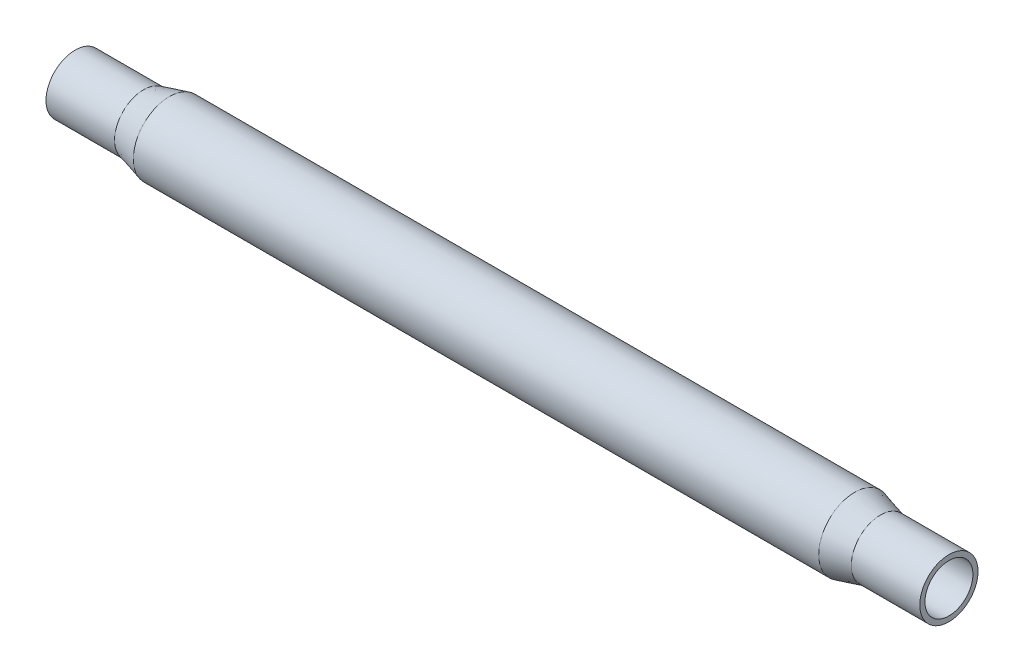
ISO-10303-21;
HEADER;
FILE_DESCRIPTION(('STEP AP214'),'2;1');
FILE_NAME('part.step','',(''),(''),'','','');
FILE_SCHEMA(('AUTOMOTIVE_DESIGN { 1 0 10303 214 1 1 1 1 }'));
ENDSEC;
DATA;
#1=APPLICATION_CONTEXT('core data for automotive mechanical design processes');
#2=APPLICATION_PROTOCOL_DEFINITION('international standard','automotive_design',2000,#1);
#3=PRODUCT_CONTEXT('',#1,'mechanical');
#4=PRODUCT('Part','Part','',(#3));
#5=PRODUCT_RELATED_PRODUCT_CATEGORY('part','',(#4));
#6=PRODUCT_DEFINITION_FORMATION('','',#4);
#7=PRODUCT_DEFINITION_CONTEXT('part definition',#1,'design');
#8=PRODUCT_DEFINITION('design','',#6,#7);
#9=PRODUCT_DEFINITION_SHAPE('','',#8);
#10=(LENGTH_UNIT() NAMED_UNIT(*) SI_UNIT(.MILLI.,.METRE.));
#11=(NAMED_UNIT(*) PLANE_ANGLE_UNIT() SI_UNIT($,.RADIAN.));
#12=(NAMED_UNIT(*) SI_UNIT($,.STERADIAN.) SOLID_ANGLE_UNIT());
#13=UNCERTAINTY_MEASURE_WITH_UNIT(LENGTH_MEASURE(1.E-05),#10,'distance_accuracy_value','');
#14=(GEOMETRIC_REPRESENTATION_CONTEXT(3) GLOBAL_UNCERTAINTY_ASSIGNED_CONTEXT((#13)) GLOBAL_UNIT_ASSIGNED_CONTEXT((#10,
#11,#12)) REPRESENTATION_CONTEXT('',''));
#15=CARTESIAN_POINT('',(0.,0.,0.));
#16=DIRECTION('',(0.,0.,1.));
#17=DIRECTION('',(1.,0.,0.));
#18=AXIS2_PLACEMENT_3D('',#15,#16,#17);
#19=CARTESIAN_POINT('',(-91.8956932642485,0.,0.));
#20=DIRECTION('',(-0.999999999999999,0.,0.));
#21=DIRECTION('',(0.,0.,1.));
#22=AXIS2_PLACEMENT_3D('',#19,#20,#21);
#23=CYLINDRICAL_SURFACE('',#22,14.);
#24=CARTESIAN_POINT('',(442.9915275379,4.44089209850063E-13,0.));
#25=DIRECTION('',(-0.999999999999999,0.,0.));
#26=DIRECTION('',(0.,0.,1.));
#27=AXIS2_PLACEMENT_3D('',#24,#25,#26);
#28=CIRCLE('',#27,14.);
#29=CARTESIAN_POINT('',(442.9915275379,0.,14.));
#30=VERTEX_POINT('',#29);
#31=EDGE_CURVE('E72',#30,#30,#28,.T.);
#32=CARTESIAN_POINT('',(402.598396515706,0.,-4.44089209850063E-13));
#33=DIRECTION('',(-0.999999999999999,0.,0.));
#34=DIRECTION('',(0.,0.,1.));
#35=AXIS2_PLACEMENT_3D('',#32,#33,#34);
#36=CIRCLE('',#35,14.);
#37=CARTESIAN_POINT('',(402.598396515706,0.,14.));
#38=VERTEX_POINT('',#37);
#39=EDGE_CURVE('E10',#38,#38,#36,.T.);
#40=CARTESIAN_POINT('',(442.9915275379,0.,14.));
#41=CARTESIAN_POINT('',(442.570765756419,0.,14.));
#42=CARTESIAN_POINT('',(442.150003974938,0.,14.));
#43=CARTESIAN_POINT('',(441.308480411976,0.,14.));
#44=CARTESIAN_POINT('',(440.887718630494,0.,14.));
#45=CARTESIAN_POINT('',(440.046195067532,0.,14.));
#46=CARTESIAN_POINT('',(439.625433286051,0.,14.));
#47=CARTESIAN_POINT('',(438.783909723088,0.,14.));
#48=CARTESIAN_POINT('',(438.363147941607,0.,14.));
#49=CARTESIAN_POINT('',(437.521624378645,0.,14.));
#50=CARTESIAN_POINT('',(437.100862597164,0.,14.));
#51=CARTESIAN_POINT('',(436.259339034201,0.,14.));
#52=CARTESIAN_POINT('',(435.83857725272,0.,14.));
#53=CARTESIAN_POINT('',(434.997053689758,0.,14.));
#54=CARTESIAN_POINT('',(434.576291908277,0.,14.));
#55=CARTESIAN_POINT('',(433.734768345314,0.,14.));
#56=CARTESIAN_POINT('',(433.314006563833,0.,14.));
#57=CARTESIAN_POINT('',(432.472483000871,0.,14.));
#58=CARTESIAN_POINT('',(432.051721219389,0.,14.));
#59=CARTESIAN_POINT('',(431.210197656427,0.,14.));
#60=CARTESIAN_POINT('',(430.789435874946,0.,14.));
#61=CARTESIAN_POINT('',(429.947912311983,0.,14.));
#62=CARTESIAN_POINT('',(429.527150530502,0.,14.));
#63=CARTESIAN_POINT('',(428.68562696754,0.,14.));
#64=CARTESIAN_POINT('',(428.264865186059,0.,14.));
#65=CARTESIAN_POINT('',(427.423341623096,0.,14.));
#66=CARTESIAN_POINT('',(427.002579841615,0.,14.));
#67=CARTESIAN_POINT('',(426.161056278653,0.,14.));
#68=CARTESIAN_POINT('',(425.740294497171,0.,14.));
#69=CARTESIAN_POINT('',(424.898770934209,0.,14.));
#70=CARTESIAN_POINT('',(424.478009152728,0.,14.));
#71=CARTESIAN_POINT('',(423.636485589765,0.,14.));
#72=CARTESIAN_POINT('',(423.215723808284,0.,14.));
#73=CARTESIAN_POINT('',(422.374200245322,0.,14.));
#74=CARTESIAN_POINT('',(421.953438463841,0.,14.));
#75=CARTESIAN_POINT('',(421.111914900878,0.,14.));
#76=CARTESIAN_POINT('',(420.691153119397,0.,14.));
#77=CARTESIAN_POINT('',(419.849629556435,0.,14.));
#78=CARTESIAN_POINT('',(419.428867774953,0.,14.));
#79=CARTESIAN_POINT('',(418.587344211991,0.,14.));
#80=CARTESIAN_POINT('',(418.16658243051,0.,14.));
#81=CARTESIAN_POINT('',(417.325058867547,0.,14.));
#82=CARTESIAN_POINT('',(416.904297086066,0.,14.));
#83=CARTESIAN_POINT('',(416.062773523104,0.,14.));
#84=CARTESIAN_POINT('',(415.642011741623,0.,14.));
#85=CARTESIAN_POINT('',(414.80048817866,0.,14.));
#86=CARTESIAN_POINT('',(414.379726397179,0.,14.));
#87=CARTESIAN_POINT('',(413.538202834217,0.,14.));
#88=CARTESIAN_POINT('',(413.117441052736,0.,14.));
#89=CARTESIAN_POINT('',(412.275917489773,0.,14.));
#90=CARTESIAN_POINT('',(411.855155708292,0.,14.));
#91=CARTESIAN_POINT('',(411.013632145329,0.,14.));
#92=CARTESIAN_POINT('',(410.592870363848,0.,14.));
#93=CARTESIAN_POINT('',(409.751346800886,0.,14.));
#94=CARTESIAN_POINT('',(409.330585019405,0.,14.));
#95=CARTESIAN_POINT('',(408.489061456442,0.,14.));
#96=CARTESIAN_POINT('',(408.068299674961,0.,14.));
#97=CARTESIAN_POINT('',(407.226776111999,0.,14.));
#98=CARTESIAN_POINT('',(406.806014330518,0.,14.));
#99=CARTESIAN_POINT('',(405.964490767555,0.,14.));
#100=CARTESIAN_POINT('',(405.543728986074,0.,14.));
#101=CARTESIAN_POINT('',(404.702205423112,0.,14.));
#102=CARTESIAN_POINT('',(404.281443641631,0.,14.));
#103=CARTESIAN_POINT('',(403.439920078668,0.,14.));
#104=CARTESIAN_POINT('',(403.019158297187,0.,14.));
#105=CARTESIAN_POINT('',(402.598396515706,0.,14.));
#106=B_SPLINE_CURVE_WITH_KNOTS('',3,(#40,#41,#42,#43,#44,#45,#46,#47,#48,#49,#50,#51,#52,#53,
#54,#55,#56,#57,#58,#59,#60,#61,#62,#63,#64,#65,#66,#67,#68,#69,#70,#71,#72,#73,#74,#75,#76,#77,
#78,#79,#80,#81,#82,#83,#84,#85,#86,#87,#88,#89,#90,#91,#92,#93,#94,#95,#96,#97,#98,#99,#100,
#101,#102,#103,#104,#105),.UNSPECIFIED.,.F.,.F.,(4,2,2,2,2,2,2,2,2,2,2,2,2,2,2,2,2,2,2,2,2,2,2,
2,2,2,2,2,2,2,2,2,4),(0.,1.26228534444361,2.52457068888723,3.78685603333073,5.04914137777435,
6.31142672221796,7.57371206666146,8.83599741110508,10.0982827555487,11.3605680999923,
12.6228534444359,13.8851387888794,15.147424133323,16.4097094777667,17.6719948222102,
18.9342801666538,20.1965655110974,21.458850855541,22.7211361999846,23.9834215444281,
25.2457068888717,26.5079922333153,27.7702775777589,29.0325629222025,30.2948482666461,
31.5571336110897,32.8194189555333,34.0817042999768,35.3439896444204,36.606274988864,
37.8685603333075,39.1308456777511,40.3931310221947),.UNSPECIFIED.);
#107=EDGE_CURVE('BSEAM32',#30,#38,#106,.T.);
#108=ORIENTED_EDGE('',*,*,#31,.F.);
#109=ORIENTED_EDGE('',*,*,#39,.T.);
#110=ORIENTED_EDGE('',*,*,#107,.T.);
#111=ORIENTED_EDGE('',*,*,#107,.F.);
#112=EDGE_LOOP('',(#108,#110,#109,#111));
#113=FACE_BOUND('',#112,.T.);
#114=ADVANCED_FACE('F32',(#113),#23,.F.);
#115=CARTESIAN_POINT('',(387.598396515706,0.,0.));
#116=DIRECTION('',(-0.999999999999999,0.,0.));
#117=DIRECTION('',(0.,0.,1.));
#118=AXIS2_PLACEMENT_3D('',#115,#116,#117);
#119=CONICAL_SURFACE('',#118,18.,0.26060239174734);
#120=CARTESIAN_POINT('',(387.598396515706,0.,0.));
#121=DIRECTION('',(-0.999999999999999,0.,0.));
#122=DIRECTION('',(0.,0.,1.));
#123=AXIS2_PLACEMENT_3D('',#120,#121,#122);
#124=CIRCLE('',#123,18.);
#125=CARTESIAN_POINT('',(387.598396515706,0.,18.));
#126=VERTEX_POINT('',#125);
#127=EDGE_CURVE('E38',#126,#126,#124,.T.);
#128=CARTESIAN_POINT('',(402.598396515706,0.,14.));
#129=CARTESIAN_POINT('',(402.442146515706,0.,14.0416666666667));
#130=CARTESIAN_POINT('',(402.285896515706,0.,14.0833333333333));
#131=CARTESIAN_POINT('',(401.973396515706,0.,14.1666666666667));
#132=CARTESIAN_POINT('',(401.817146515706,0.,14.2083333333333));
#133=CARTESIAN_POINT('',(401.504646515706,0.,14.2916666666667));
#134=CARTESIAN_POINT('',(401.348396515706,0.,14.3333333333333));
#135=CARTESIAN_POINT('',(401.035896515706,0.,14.4166666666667));
#136=CARTESIAN_POINT('',(400.879646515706,0.,14.4583333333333));
#137=CARTESIAN_POINT('',(400.567146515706,0.,14.5416666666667));
#138=CARTESIAN_POINT('',(400.410896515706,0.,14.5833333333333));
#139=CARTESIAN_POINT('',(400.098396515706,0.,14.6666666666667));
#140=CARTESIAN_POINT('',(399.942146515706,0.,14.7083333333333));
#141=CARTESIAN_POINT('',(399.629646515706,0.,14.7916666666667));
#142=CARTESIAN_POINT('',(399.473396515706,0.,14.8333333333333));
#143=CARTESIAN_POINT('',(399.160896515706,0.,14.9166666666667));
#144=CARTESIAN_POINT('',(399.004646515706,0.,14.9583333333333));
#145=CARTESIAN_POINT('',(398.692146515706,0.,15.0416666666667));
#146=CARTESIAN_POINT('',(398.535896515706,0.,15.0833333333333));
#147=CARTESIAN_POINT('',(398.223396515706,0.,15.1666666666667));
#148=CARTESIAN_POINT('',(398.067146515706,0.,15.2083333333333));
#149=CARTESIAN_POINT('',(397.754646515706,0.,15.2916666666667));
#150=CARTESIAN_POINT('',(397.598396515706,0.,15.3333333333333));
#151=CARTESIAN_POINT('',(397.285896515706,0.,15.4166666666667));
#152=CARTESIAN_POINT('',(397.129646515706,0.,15.4583333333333));
#153=CARTESIAN_POINT('',(396.817146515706,0.,15.5416666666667));
#154=CARTESIAN_POINT('',(396.660896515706,0.,15.5833333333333));
#155=CARTESIAN_POINT('',(396.348396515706,0.,15.6666666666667));
#156=CARTESIAN_POINT('',(396.192146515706,0.,15.7083333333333));
#157=CARTESIAN_POINT('',(395.879646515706,0.,15.7916666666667));
#158=CARTESIAN_POINT('',(395.723396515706,0.,15.8333333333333));
#159=CARTESIAN_POINT('',(395.410896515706,0.,15.9166666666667));
#160=CARTESIAN_POINT('',(395.254646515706,0.,15.9583333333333));
#161=CARTESIAN_POINT('',(394.942146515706,0.,16.0416666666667));
#162=CARTESIAN_POINT('',(394.785896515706,0.,16.0833333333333));
#163=CARTESIAN_POINT('',(394.473396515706,0.,16.1666666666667));
#164=CARTESIAN_POINT('',(394.317146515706,0.,16.2083333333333));
#165=CARTESIAN_POINT('',(394.004646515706,0.,16.2916666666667));
#166=CARTESIAN_POINT('',(393.848396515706,0.,16.3333333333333));
#167=CARTESIAN_POINT('',(393.535896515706,0.,16.4166666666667));
#168=CARTESIAN_POINT('',(393.379646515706,0.,16.4583333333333));
#169=CARTESIAN_POINT('',(393.067146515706,0.,16.5416666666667));
#170=CARTESIAN_POINT('',(392.910896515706,0.,16.5833333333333));
#171=CARTESIAN_POINT('',(392.598396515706,0.,16.6666666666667));
#172=CARTESIAN_POINT('',(392.442146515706,0.,16.7083333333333));
#173=CARTESIAN_POINT('',(392.129646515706,0.,16.7916666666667));
#174=CARTESIAN_POINT('',(391.973396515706,0.,16.8333333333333));
#175=CARTESIAN_POINT('',(391.660896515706,0.,16.9166666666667));
#176=CARTESIAN_POINT('',(391.504646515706,0.,16.9583333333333));
#177=CARTESIAN_POINT('',(391.192146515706,0.,17.0416666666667));
#178=CARTESIAN_POINT('',(391.035896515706,0.,17.0833333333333));
#179=CARTESIAN_POINT('',(390.723396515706,0.,17.1666666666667));
#180=CARTESIAN_POINT('',(390.567146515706,0.,17.2083333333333));
#181=CARTESIAN_POINT('',(390.254646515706,0.,17.2916666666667));
#182=CARTESIAN_POINT('',(390.098396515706,0.,17.3333333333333));
#183=CARTESIAN_POINT('',(389.785896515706,0.,17.4166666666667));
#184=CARTESIAN_POINT('',(389.629646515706,0.,17.4583333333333));
#185=CARTESIAN_POINT('',(389.317146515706,0.,17.5416666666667));
#186=CARTESIAN_POINT('',(389.160896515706,0.,17.5833333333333));
#187=CARTESIAN_POINT('',(388.848396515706,0.,17.6666666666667));
#188=CARTESIAN_POINT('',(388.692146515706,0.,17.7083333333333));
#189=CARTESIAN_POINT('',(388.379646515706,0.,17.7916666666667));
#190=CARTESIAN_POINT('',(388.223396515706,0.,17.8333333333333));
#191=CARTESIAN_POINT('',(387.910896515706,0.,17.9166666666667));
#192=CARTESIAN_POINT('',(387.754646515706,0.,17.9583333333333));
#193=CARTESIAN_POINT('',(387.598396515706,0.,18.));
#194=B_SPLINE_CURVE_WITH_KNOTS('',3,(#128,#129,#130,#131,#132,#133,#134,#135,#136,#137,#138,
#139,#140,#141,#142,#143,#144,#145,#146,#147,#148,#149,#150,#151,#152,#153,#154,#155,#156,#157,
#158,#159,#160,#161,#162,#163,#164,#165,#166,#167,#168,#169,#170,#171,#172,#173,#174,#175,#176,
#177,#178,#179,#180,#181,#182,#183,#184,#185,#186,#187,#188,#189,#190,#191,#192,#193),
.UNSPECIFIED.,.F.,.F.,(4,2,2,2,2,2,2,2,2,2,2,2,2,2,2,2,2,2,2,2,2,2,2,2,2,2,2,2,2,2,2,2,4),(0.,
0.485130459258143,0.970260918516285,1.45539137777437,1.94052183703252,2.42565229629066,
2.91078275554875,3.39591321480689,3.88104367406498,4.36617413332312,4.85130459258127,
5.33643505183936,5.8215655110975,6.30669597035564,6.79182642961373,7.27695688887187,
7.76208734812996,8.2472178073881,8.73234826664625,9.21747872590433,9.70260918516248,
10.1877396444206,10.6728701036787,11.1580005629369,11.6431310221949,12.1282614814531,
12.6133919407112,13.0985223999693,13.5836528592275,14.0687833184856,14.5539137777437,
15.0390442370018,15.52417469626),.UNSPECIFIED.);
#195=EDGE_CURVE('BSEAM80',#38,#126,#194,.T.);
#196=ORIENTED_EDGE('',*,*,#39,.F.);
#197=ORIENTED_EDGE('',*,*,#127,.T.);
#198=ORIENTED_EDGE('',*,*,#195,.T.);
#199=ORIENTED_EDGE('',*,*,#195,.F.);
#200=EDGE_LOOP('',(#196,#198,#197,#199));
#201=FACE_BOUND('',#200,.T.);
#202=ADVANCED_FACE('F80',(#201),#119,.F.);
#203=CARTESIAN_POINT('',(-91.8956932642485,0.,0.));
#204=DIRECTION('',(-0.999999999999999,0.,0.));
#205=DIRECTION('',(0.,0.,1.));
#206=AXIS2_PLACEMENT_3D('',#203,#204,#205);
#207=CYLINDRICAL_SURFACE('',#206,18.);
#208=CARTESIAN_POINT('',(-11.6153414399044,4.44089209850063E-13,0.));
#209=DIRECTION('',(-0.999999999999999,0.,0.));
#210=DIRECTION('',(0.,0.,1.));
#211=AXIS2_PLACEMENT_3D('',#208,#209,#210);
#212=CIRCLE('',#211,18.);
#213=CARTESIAN_POINT('',(-11.6153414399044,0.,18.));
#214=VERTEX_POINT('',#213);
#215=EDGE_CURVE('E42',#214,#214,#212,.T.);
#216=CARTESIAN_POINT('',(387.598396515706,0.,18.));
#217=CARTESIAN_POINT('',(383.439920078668,0.,18.));
#218=CARTESIAN_POINT('',(379.281443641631,0.,18.));
#219=CARTESIAN_POINT('',(370.964490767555,0.,18.));
#220=CARTESIAN_POINT('',(366.806014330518,0.,18.));
#221=CARTESIAN_POINT('',(358.489061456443,0.,18.));
#222=CARTESIAN_POINT('',(354.330585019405,0.,18.));
#223=CARTESIAN_POINT('',(346.01363214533,0.,18.));
#224=CARTESIAN_POINT('',(341.855155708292,0.,18.));
#225=CARTESIAN_POINT('',(333.538202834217,0.,18.));
#226=CARTESIAN_POINT('',(329.379726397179,0.,18.));
#227=CARTESIAN_POINT('',(321.062773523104,0.,18.));
#228=CARTESIAN_POINT('',(316.904297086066,0.,18.));
#229=CARTESIAN_POINT('',(308.587344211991,0.,18.));
#230=CARTESIAN_POINT('',(304.428867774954,0.,18.));
#231=CARTESIAN_POINT('',(296.111914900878,0.,18.));
#232=CARTESIAN_POINT('',(291.953438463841,0.,18.));
#233=CARTESIAN_POINT('',(283.636485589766,0.,18.));
#234=CARTESIAN_POINT('',(279.478009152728,0.,18.));
#235=CARTESIAN_POINT('',(271.161056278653,0.,18.));
#236=CARTESIAN_POINT('',(267.002579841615,0.,18.));
#237=CARTESIAN_POINT('',(258.68562696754,0.,18.));
#238=CARTESIAN_POINT('',(254.527150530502,0.,18.));
#239=CARTESIAN_POINT('',(246.210197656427,0.,18.));
#240=CARTESIAN_POINT('',(242.05172121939,0.,18.));
#241=CARTESIAN_POINT('',(233.734768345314,0.,18.));
#242=CARTESIAN_POINT('',(229.576291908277,0.,18.));
#243=CARTESIAN_POINT('',(221.259339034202,0.,18.));
#244=CARTESIAN_POINT('',(217.100862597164,0.,18.));
#245=CARTESIAN_POINT('',(208.783909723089,0.,18.));
#246=CARTESIAN_POINT('',(204.625433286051,0.,18.));
#247=CARTESIAN_POINT('',(196.308480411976,0.,18.));
#248=CARTESIAN_POINT('',(192.150003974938,0.,18.));
#249=CARTESIAN_POINT('',(183.833051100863,0.,18.));
#250=CARTESIAN_POINT('',(179.674574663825,0.,18.));
#251=CARTESIAN_POINT('',(171.35762178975,0.,18.));
#252=CARTESIAN_POINT('',(167.199145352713,0.,18.));
#253=CARTESIAN_POINT('',(158.882192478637,0.,18.));
#254=CARTESIAN_POINT('',(154.7237160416,0.,18.));
#255=CARTESIAN_POINT('',(146.406763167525,0.,18.));
#256=CARTESIAN_POINT('',(142.248286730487,0.,18.));
#257=CARTESIAN_POINT('',(133.931333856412,0.,18.));
#258=CARTESIAN_POINT('',(129.772857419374,0.,18.));
#259=CARTESIAN_POINT('',(121.455904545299,0.,18.));
#260=CARTESIAN_POINT('',(117.297428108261,0.,18.));
#261=CARTESIAN_POINT('',(108.980475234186,0.,18.));
#262=CARTESIAN_POINT('',(104.821998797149,0.,18.));
#263=CARTESIAN_POINT('',(96.5050459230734,0.,18.));
#264=CARTESIAN_POINT('',(92.3465694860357,0.,18.));
#265=CARTESIAN_POINT('',(84.0296166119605,0.,18.));
#266=CARTESIAN_POINT('',(79.8711401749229,0.,18.));
#267=CARTESIAN_POINT('',(71.5541873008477,0.,18.));
#268=CARTESIAN_POINT('',(67.3957108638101,0.,18.));
#269=CARTESIAN_POINT('',(59.0787579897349,0.,18.));
#270=CARTESIAN_POINT('',(54.9202815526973,0.,18.));
#271=CARTESIAN_POINT('',(46.6033286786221,0.,18.));
#272=CARTESIAN_POINT('',(42.4448522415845,0.,18.));
#273=CARTESIAN_POINT('',(34.1278993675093,0.,18.));
#274=CARTESIAN_POINT('',(29.9694229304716,0.,18.));
#275=CARTESIAN_POINT('',(21.6524700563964,0.,18.));
#276=CARTESIAN_POINT('',(17.4939936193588,0.,18.));
#277=CARTESIAN_POINT('',(9.17704074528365,0.,18.));
#278=CARTESIAN_POINT('',(5.01856430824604,0.,18.));
#279=CARTESIAN_POINT('',(-3.29838856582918,0.,18.));
#280=CARTESIAN_POINT('',(-7.45686500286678,0.,18.));
#281=CARTESIAN_POINT('',(-11.6153414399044,0.,18.));
#282=B_SPLINE_CURVE_WITH_KNOTS('',3,(#216,#217,#218,#219,#220,#221,#222,#223,#224,#225,#226,
#227,#228,#229,#230,#231,#232,#233,#234,#235,#236,#237,#238,#239,#240,#241,#242,#243,#244,#245,
#246,#247,#248,#249,#250,#251,#252,#253,#254,#255,#256,#257,#258,#259,#260,#261,#262,#263,#264,
#265,#266,#267,#268,#269,#270,#271,#272,#273,#274,#275,#276,#277,#278,#279,#280,#281),
.UNSPECIFIED.,.F.,.F.,(4,2,2,2,2,2,2,2,2,2,2,2,2,2,2,2,2,2,2,2,2,2,2,2,2,2,2,2,2,2,2,2,4),(0.,
12.4754293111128,24.9508586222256,37.4262879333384,49.9017172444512,62.3771465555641,
74.8525758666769,87.3280051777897,99.8034344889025,112.278863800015,124.754293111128,
137.229722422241,149.705151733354,162.180581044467,174.656010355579,187.131439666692,
199.606868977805,212.082298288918,224.557727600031,237.033156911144,249.508586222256,
261.984015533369,274.459444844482,286.934874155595,299.410303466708,311.885732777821,
324.361162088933,336.836591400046,349.312020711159,361.787450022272,374.262879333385,
386.738308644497,399.21373795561),.UNSPECIFIED.);
#283=EDGE_CURVE('BSEAM84',#126,#214,#282,.T.);
#284=ORIENTED_EDGE('',*,*,#127,.F.);
#285=ORIENTED_EDGE('',*,*,#215,.T.);
#286=ORIENTED_EDGE('',*,*,#283,.T.);
#287=ORIENTED_EDGE('',*,*,#283,.F.);
#288=EDGE_LOOP('',(#284,#286,#285,#287));
#289=FACE_BOUND('',#288,.T.);
#290=ADVANCED_FACE('F84',(#289),#207,.F.);
#291=CARTESIAN_POINT('',(-26.6153414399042,4.44089209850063E-13,4.44089209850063E-13));
#292=DIRECTION('',(0.999999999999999,0.,0.));
#293=DIRECTION('',(0.,0.,-1.));
#294=AXIS2_PLACEMENT_3D('',#291,#292,#293);
#295=CONICAL_SURFACE('',#294,14.,0.260602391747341);
#296=ORIENTED_EDGE('',*,*,#215,.F.);
#297=EDGE_LOOP('',(#296));
#298=FACE_BOUND('',#297,.T.);
#299=CARTESIAN_POINT('',(-26.6153414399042,4.44089209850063E-13,4.44089209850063E-13));
#300=DIRECTION('',(-0.999999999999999,0.,0.));
#301=DIRECTION('',(0.,0.,1.));
#302=AXIS2_PLACEMENT_3D('',#299,#300,#301);
#303=CIRCLE('',#302,14.);
#304=CARTESIAN_POINT('',(-26.6153414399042,0.,14.));
#305=VERTEX_POINT('',#304);
#306=EDGE_CURVE('E46',#305,#305,#303,.T.);
#307=ORIENTED_EDGE('',*,*,#306,.T.);
#308=EDGE_LOOP('',(#307));
#309=FACE_BOUND('',#308,.T.);
#310=ADVANCED_FACE('F89',(#298,#309),#295,.F.);
#311=CARTESIAN_POINT('',(-91.8956932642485,0.,0.));
#312=DIRECTION('',(-0.999999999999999,0.,0.));
#313=DIRECTION('',(0.,0.,1.));
#314=AXIS2_PLACEMENT_3D('',#311,#312,#313);
#315=CYLINDRICAL_SURFACE('',#314,14.);
#316=CARTESIAN_POINT('',(-67.0084724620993,0.,0.));
#317=DIRECTION('',(-0.999999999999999,0.,0.));
#318=DIRECTION('',(0.,0.,1.));
#319=AXIS2_PLACEMENT_3D('',#316,#317,#318);
#320=CIRCLE('',#319,14.);
#321=CARTESIAN_POINT('',(-67.0084724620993,0.,14.));
#322=VERTEX_POINT('',#321);
#323=EDGE_CURVE('E51',#322,#322,#320,.T.);
#324=CARTESIAN_POINT('',(-26.6153414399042,0.,14.));
#325=CARTESIAN_POINT('',(-27.0361032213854,0.,14.));
#326=CARTESIAN_POINT('',(-27.4568650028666,0.,14.));
#327=CARTESIAN_POINT('',(-28.298388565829,0.,14.));
#328=CARTESIAN_POINT('',(-28.7191503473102,0.,14.));
#329=CARTESIAN_POINT('',(-29.5606739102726,0.,14.));
#330=CARTESIAN_POINT('',(-29.9814356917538,0.,14.));
#331=CARTESIAN_POINT('',(-30.8229592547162,0.,14.));
#332=CARTESIAN_POINT('',(-31.2437210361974,0.,14.));
#333=CARTESIAN_POINT('',(-32.0852445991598,0.,14.));
#334=CARTESIAN_POINT('',(-32.506006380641,0.,14.));
#335=CARTESIAN_POINT('',(-33.3475299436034,0.,14.));
#336=CARTESIAN_POINT('',(-33.7682917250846,0.,14.));
#337=CARTESIAN_POINT('',(-34.609815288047,0.,14.));
#338=CARTESIAN_POINT('',(-35.0305770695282,0.,14.));
#339=CARTESIAN_POINT('',(-35.8721006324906,0.,14.));
#340=CARTESIAN_POINT('',(-36.2928624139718,0.,14.));
#341=CARTESIAN_POINT('',(-37.1343859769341,0.,14.));
#342=CARTESIAN_POINT('',(-37.5551477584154,0.,14.));
#343=CARTESIAN_POINT('',(-38.3966713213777,0.,14.));
#344=CARTESIAN_POINT('',(-38.8174331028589,0.,14.));
#345=CARTESIAN_POINT('',(-39.6589566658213,0.,14.));
#346=CARTESIAN_POINT('',(-40.0797184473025,0.,14.));
#347=CARTESIAN_POINT('',(-40.9212420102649,0.,14.));
#348=CARTESIAN_POINT('',(-41.3420037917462,0.,14.));
#349=CARTESIAN_POINT('',(-42.1835273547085,0.,14.));
#350=CARTESIAN_POINT('',(-42.6042891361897,0.,14.));
#351=CARTESIAN_POINT('',(-43.4458126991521,0.,14.));
#352=CARTESIAN_POINT('',(-43.8665744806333,0.,14.));
#353=CARTESIAN_POINT('',(-44.7080980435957,0.,14.));
#354=CARTESIAN_POINT('',(-45.1288598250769,0.,14.));
#355=CARTESIAN_POINT('',(-45.9703833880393,0.,14.));
#356=CARTESIAN_POINT('',(-46.3911451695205,0.,14.));
#357=CARTESIAN_POINT('',(-47.2326687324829,0.,14.));
#358=CARTESIAN_POINT('',(-47.6534305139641,0.,14.));
#359=CARTESIAN_POINT('',(-48.4949540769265,0.,14.));
#360=CARTESIAN_POINT('',(-48.9157158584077,0.,14.));
#361=CARTESIAN_POINT('',(-49.7572394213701,0.,14.));
#362=CARTESIAN_POINT('',(-50.1780012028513,0.,14.));
#363=CARTESIAN_POINT('',(-51.0195247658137,0.,14.));
#364=CARTESIAN_POINT('',(-51.4402865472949,0.,14.));
#365=CARTESIAN_POINT('',(-52.2818101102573,0.,14.));
#366=CARTESIAN_POINT('',(-52.7025718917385,0.,14.));
#367=CARTESIAN_POINT('',(-53.5440954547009,0.,14.));
#368=CARTESIAN_POINT('',(-53.9648572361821,0.,14.));
#369=CARTESIAN_POINT('',(-54.8063807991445,0.,14.));
#370=CARTESIAN_POINT('',(-55.2271425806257,0.,14.));
#371=CARTESIAN_POINT('',(-56.0686661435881,0.,14.));
#372=CARTESIAN_POINT('',(-56.4894279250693,0.,14.));
#373=CARTESIAN_POINT('',(-57.3309514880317,0.,14.));
#374=CARTESIAN_POINT('',(-57.7517132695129,0.,14.));
#375=CARTESIAN_POINT('',(-58.5932368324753,0.,14.));
#376=CARTESIAN_POINT('',(-59.0139986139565,0.,14.));
#377=CARTESIAN_POINT('',(-59.8555221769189,0.,14.));
#378=CARTESIAN_POINT('',(-60.2762839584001,0.,14.));
#379=CARTESIAN_POINT('',(-61.1178075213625,0.,14.));
#380=CARTESIAN_POINT('',(-61.5385693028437,0.,14.));
#381=CARTESIAN_POINT('',(-62.3800928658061,0.,14.));
#382=CARTESIAN_POINT('',(-62.8008546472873,0.,14.));
#383=CARTESIAN_POINT('',(-63.6423782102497,0.,14.));
#384=CARTESIAN_POINT('',(-64.0631399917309,0.,14.));
#385=CARTESIAN_POINT('',(-64.9046635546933,0.,14.));
#386=CARTESIAN_POINT('',(-65.3254253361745,0.,14.));
#387=CARTESIAN_POINT('',(-66.1669488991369,0.,14.));
#388=CARTESIAN_POINT('',(-66.5877106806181,0.,14.));
#389=CARTESIAN_POINT('',(-67.0084724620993,0.,14.));
#390=B_SPLINE_CURVE_WITH_KNOTS('',3,(#324,#325,#326,#327,#328,#329,#330,#331,#332,#333,#334,
#335,#336,#337,#338,#339,#340,#341,#342,#343,#344,#345,#346,#347,#348,#349,#350,#351,#352,#353,
#354,#355,#356,#357,#358,#359,#360,#361,#362,#363,#364,#365,#366,#367,#368,#369,#370,#371,#372,
#373,#374,#375,#376,#377,#378,#379,#380,#381,#382,#383,#384,#385,#386,#387,#388,#389),
.UNSPECIFIED.,.F.,.F.,(4,2,2,2,2,2,2,2,2,2,2,2,2,2,2,2,2,2,2,2,2,2,2,2,2,2,2,2,2,2,2,2,4),(0.,
1.2622853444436,2.5245706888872,3.78685603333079,5.04914137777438,6.31142672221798,
7.57371206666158,8.83599741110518,10.0982827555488,11.3605680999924,12.622853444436,
13.8851387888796,15.1474241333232,16.4097094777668,17.6719948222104,18.9342801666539,
20.1965655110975,21.4588508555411,22.7211361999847,23.9834215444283,25.2457068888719,
26.5079922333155,27.7702775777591,29.0325629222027,30.2948482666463,31.5571336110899,
32.8194189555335,34.0817042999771,35.3439896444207,36.6062749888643,37.8685603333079,
39.1308456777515,40.3931310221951),.UNSPECIFIED.);
#391=EDGE_CURVE('BSEAM95',#305,#322,#390,.T.);
#392=ORIENTED_EDGE('',*,*,#306,.F.);
#393=ORIENTED_EDGE('',*,*,#323,.T.);
#394=ORIENTED_EDGE('',*,*,#391,.T.);
#395=ORIENTED_EDGE('',*,*,#391,.F.);
#396=EDGE_LOOP('',(#392,#394,#393,#395));
#397=FACE_BOUND('',#396,.T.);
#398=ADVANCED_FACE('F95',(#397),#315,.F.);
#399=CARTESIAN_POINT('',(-67.0084724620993,13.9999999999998,-4.44089209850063E-13));
#400=DIRECTION('',(-0.999999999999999,0.,0.));
#401=DIRECTION('',(0.,0.,1.));
#402=AXIS2_PLACEMENT_3D('',#399,#400,#401);
#403=PLANE('',#402);
#404=CARTESIAN_POINT('',(-67.0084724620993,0.,0.));
#405=DIRECTION('',(-0.999999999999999,0.,0.));
#406=DIRECTION('',(0.,0.,1.));
#407=AXIS2_PLACEMENT_3D('',#404,#405,#406);
#408=CIRCLE('',#407,17.);
#409=CARTESIAN_POINT('',(-67.0084724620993,0.,17.));
#410=VERTEX_POINT('',#409);
#411=EDGE_CURVE('E54',#410,#410,#408,.T.);
#412=ORIENTED_EDGE('',*,*,#411,.T.);
#413=EDGE_LOOP('',(#412));
#414=FACE_BOUND('',#413,.T.);
#415=ORIENTED_EDGE('',*,*,#323,.F.);
#416=EDGE_LOOP('',(#415));
#417=FACE_BOUND('',#416,.T.);
#418=ADVANCED_FACE('F99',(#414,#417),#403,.T.);
#419=CARTESIAN_POINT('',(-91.8956932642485,0.,0.));
#420=DIRECTION('',(-0.999999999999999,0.,0.));
#421=DIRECTION('',(0.,0.,1.));
#422=AXIS2_PLACEMENT_3D('',#419,#420,#421);
#423=CYLINDRICAL_SURFACE('',#422,17.);
#424=CARTESIAN_POINT('',(-27.0084724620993,0.,0.));
#425=DIRECTION('',(-0.999999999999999,0.,0.));
#426=DIRECTION('',(0.,0.,1.));
#427=AXIS2_PLACEMENT_3D('',#424,#425,#426);
#428=CIRCLE('',#427,17.);
#429=CARTESIAN_POINT('',(-27.0084724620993,0.,17.));
#430=VERTEX_POINT('',#429);
#431=EDGE_CURVE('E57',#430,#430,#428,.T.);
#432=CARTESIAN_POINT('',(-27.0084724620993,0.,17.));
#433=CARTESIAN_POINT('',(-27.4251391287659,0.,17.));
#434=CARTESIAN_POINT('',(-27.8418057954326,0.,17.));
#435=CARTESIAN_POINT('',(-28.6751391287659,0.,17.));
#436=CARTESIAN_POINT('',(-29.0918057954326,0.,17.));
#437=CARTESIAN_POINT('',(-29.9251391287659,0.,17.));
#438=CARTESIAN_POINT('',(-30.3418057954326,0.,17.));
#439=CARTESIAN_POINT('',(-31.1751391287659,0.,17.));
#440=CARTESIAN_POINT('',(-31.5918057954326,0.,17.));
#441=CARTESIAN_POINT('',(-32.4251391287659,0.,17.));
#442=CARTESIAN_POINT('',(-32.8418057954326,0.,17.));
#443=CARTESIAN_POINT('',(-33.6751391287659,0.,17.));
#444=CARTESIAN_POINT('',(-34.0918057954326,0.,17.));
#445=CARTESIAN_POINT('',(-34.9251391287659,0.,17.));
#446=CARTESIAN_POINT('',(-35.3418057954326,0.,17.));
#447=CARTESIAN_POINT('',(-36.1751391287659,0.,17.));
#448=CARTESIAN_POINT('',(-36.5918057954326,0.,17.));
#449=CARTESIAN_POINT('',(-37.4251391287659,0.,17.));
#450=CARTESIAN_POINT('',(-37.8418057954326,0.,17.));
#451=CARTESIAN_POINT('',(-38.6751391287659,0.,17.));
#452=CARTESIAN_POINT('',(-39.0918057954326,0.,17.));
#453=CARTESIAN_POINT('',(-39.9251391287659,0.,17.));
#454=CARTESIAN_POINT('',(-40.3418057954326,0.,17.));
#455=CARTESIAN_POINT('',(-41.1751391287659,0.,17.));
#456=CARTESIAN_POINT('',(-41.5918057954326,0.,17.));
#457=CARTESIAN_POINT('',(-42.4251391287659,0.,17.));
#458=CARTESIAN_POINT('',(-42.8418057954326,0.,17.));
#459=CARTESIAN_POINT('',(-43.6751391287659,0.,17.));
#460=CARTESIAN_POINT('',(-44.0918057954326,0.,17.));
#461=CARTESIAN_POINT('',(-44.9251391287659,0.,17.));
#462=CARTESIAN_POINT('',(-45.3418057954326,0.,17.));
#463=CARTESIAN_POINT('',(-46.1751391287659,0.,17.));
#464=CARTESIAN_POINT('',(-46.5918057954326,0.,17.));
#465=CARTESIAN_POINT('',(-47.4251391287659,0.,17.));
#466=CARTESIAN_POINT('',(-47.8418057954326,0.,17.));
#467=CARTESIAN_POINT('',(-48.6751391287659,0.,17.));
#468=CARTESIAN_POINT('',(-49.0918057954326,0.,17.));
#469=CARTESIAN_POINT('',(-49.9251391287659,0.,17.));
#470=CARTESIAN_POINT('',(-50.3418057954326,0.,17.));
#471=CARTESIAN_POINT('',(-51.1751391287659,0.,17.));
#472=CARTESIAN_POINT('',(-51.5918057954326,0.,17.));
#473=CARTESIAN_POINT('',(-52.4251391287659,0.,17.));
#474=CARTESIAN_POINT('',(-52.8418057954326,0.,17.));
#475=CARTESIAN_POINT('',(-53.6751391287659,0.,17.));
#476=CARTESIAN_POINT('',(-54.0918057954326,0.,17.));
#477=CARTESIAN_POINT('',(-54.9251391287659,0.,17.));
#478=CARTESIAN_POINT('',(-55.3418057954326,0.,17.));
#479=CARTESIAN_POINT('',(-56.1751391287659,0.,17.));
#480=CARTESIAN_POINT('',(-56.5918057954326,0.,17.));
#481=CARTESIAN_POINT('',(-57.4251391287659,0.,17.));
#482=CARTESIAN_POINT('',(-57.8418057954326,0.,17.));
#483=CARTESIAN_POINT('',(-58.6751391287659,0.,17.));
#484=CARTESIAN_POINT('',(-59.0918057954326,0.,17.));
#485=CARTESIAN_POINT('',(-59.9251391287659,0.,17.));
#486=CARTESIAN_POINT('',(-60.3418057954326,0.,17.));
#487=CARTESIAN_POINT('',(-61.1751391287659,0.,17.));
#488=CARTESIAN_POINT('',(-61.5918057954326,0.,17.));
#489=CARTESIAN_POINT('',(-62.425139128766,0.,17.));
#490=CARTESIAN_POINT('',(-62.8418057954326,0.,17.));
#491=CARTESIAN_POINT('',(-63.6751391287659,0.,17.));
#492=CARTESIAN_POINT('',(-64.0918057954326,0.,17.));
#493=CARTESIAN_POINT('',(-64.9251391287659,0.,17.));
#494=CARTESIAN_POINT('',(-65.3418057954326,0.,17.));
#495=CARTESIAN_POINT('',(-66.1751391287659,0.,17.));
#496=CARTESIAN_POINT('',(-66.5918057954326,0.,17.));
#497=CARTESIAN_POINT('',(-67.0084724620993,0.,17.));
#498=B_SPLINE_CURVE_WITH_KNOTS('',3,(#432,#433,#434,#435,#436,#437,#438,#439,#440,#441,#442,
#443,#444,#445,#446,#447,#448,#449,#450,#451,#452,#453,#454,#455,#456,#457,#458,#459,#460,#461,
#462,#463,#464,#465,#466,#467,#468,#469,#470,#471,#472,#473,#474,#475,#476,#477,#478,#479,#480,
#481,#482,#483,#484,#485,#486,#487,#488,#489,#490,#491,#492,#493,#494,#495,#496,#497),
.UNSPECIFIED.,.F.,.F.,(4,2,2,2,2,2,2,2,2,2,2,2,2,2,2,2,2,2,2,2,2,2,2,2,2,2,2,2,2,2,2,2,4),(0.,
1.25,2.5,3.75,5.,6.25000000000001,7.5,8.75,10.,11.25,12.5,13.75,15.,16.25,17.5,18.75,20.,21.25,
22.5,23.75,25.,26.25,27.5,28.75,30.,31.25,32.5,33.75,35.,36.25,37.5,38.75,40.),.UNSPECIFIED.);
#499=EDGE_CURVE('BSEAM103',#430,#410,#498,.T.);
#500=ORIENTED_EDGE('',*,*,#431,.T.);
#501=ORIENTED_EDGE('',*,*,#411,.F.);
#502=ORIENTED_EDGE('',*,*,#499,.T.);
#503=ORIENTED_EDGE('',*,*,#499,.F.);
#504=EDGE_LOOP('',(#500,#502,#501,#503));
#505=FACE_BOUND('',#504,.T.);
#506=ADVANCED_FACE('F103',(#505),#423,.T.);
#507=CARTESIAN_POINT('',(-27.0084724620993,0.,0.));
#508=DIRECTION('',(0.999999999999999,0.,0.));
#509=DIRECTION('',(0.,0.,-1.));
#510=AXIS2_PLACEMENT_3D('',#507,#508,#509);
#511=CONICAL_SURFACE('',#510,17.,0.260602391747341);
#512=CARTESIAN_POINT('',(-12.0084724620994,0.,-4.44089209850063E-13));
#513=DIRECTION('',(-0.999999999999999,0.,0.));
#514=DIRECTION('',(0.,0.,1.));
#515=AXIS2_PLACEMENT_3D('',#512,#513,#514);
#516=CIRCLE('',#515,21.);
#517=CARTESIAN_POINT('',(-12.0084724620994,0.,21.));
#518=VERTEX_POINT('',#517);
#519=EDGE_CURVE('E60',#518,#518,#516,.T.);
#520=ORIENTED_EDGE('',*,*,#519,.T.);
#521=EDGE_LOOP('',(#520));
#522=FACE_BOUND('',#521,.T.);
#523=ORIENTED_EDGE('',*,*,#431,.F.);
#524=EDGE_LOOP('',(#523));
#525=FACE_BOUND('',#524,.T.);
#526=ADVANCED_FACE('F107',(#522,#525),#511,.T.);
#527=CARTESIAN_POINT('',(-91.8956932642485,0.,0.));
#528=DIRECTION('',(-0.999999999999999,0.,0.));
#529=DIRECTION('',(0.,0.,1.));
#530=AXIS2_PLACEMENT_3D('',#527,#528,#529);
#531=CYLINDRICAL_SURFACE('',#530,21.);
#532=CARTESIAN_POINT('',(387.9915275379,4.44089209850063E-13,0.));
#533=DIRECTION('',(-0.999999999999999,0.,0.));
#534=DIRECTION('',(0.,0.,1.));
#535=AXIS2_PLACEMENT_3D('',#532,#533,#534);
#536=CIRCLE('',#535,21.);
#537=CARTESIAN_POINT('',(387.9915275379,0.,21.));
#538=VERTEX_POINT('',#537);
#539=EDGE_CURVE('E63',#538,#538,#536,.T.);
#540=CARTESIAN_POINT('',(387.9915275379,0.,21.));
#541=CARTESIAN_POINT('',(383.824860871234,0.,21.));
#542=CARTESIAN_POINT('',(379.658194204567,0.,21.));
#543=CARTESIAN_POINT('',(371.324860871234,0.,21.));
#544=CARTESIAN_POINT('',(367.158194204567,0.,21.));
#545=CARTESIAN_POINT('',(358.824860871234,0.,21.));
#546=CARTESIAN_POINT('',(354.658194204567,0.,21.));
#547=CARTESIAN_POINT('',(346.324860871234,0.,21.));
#548=CARTESIAN_POINT('',(342.158194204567,0.,21.));
#549=CARTESIAN_POINT('',(333.824860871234,0.,21.));
#550=CARTESIAN_POINT('',(329.658194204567,0.,21.));
#551=CARTESIAN_POINT('',(321.324860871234,0.,21.));
#552=CARTESIAN_POINT('',(317.158194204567,0.,21.));
#553=CARTESIAN_POINT('',(308.824860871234,0.,21.));
#554=CARTESIAN_POINT('',(304.658194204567,0.,21.));
#555=CARTESIAN_POINT('',(296.324860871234,0.,21.));
#556=CARTESIAN_POINT('',(292.158194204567,0.,21.));
#557=CARTESIAN_POINT('',(283.824860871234,0.,21.));
#558=CARTESIAN_POINT('',(279.658194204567,0.,21.));
#559=CARTESIAN_POINT('',(271.324860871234,0.,21.));
#560=CARTESIAN_POINT('',(267.158194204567,0.,21.));
#561=CARTESIAN_POINT('',(258.824860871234,0.,21.));
#562=CARTESIAN_POINT('',(254.658194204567,0.,21.));
#563=CARTESIAN_POINT('',(246.324860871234,0.,21.));
#564=CARTESIAN_POINT('',(242.158194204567,0.,21.));
#565=CARTESIAN_POINT('',(233.824860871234,0.,21.));
#566=CARTESIAN_POINT('',(229.658194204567,0.,21.));
#567=CARTESIAN_POINT('',(221.324860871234,0.,21.));
#568=CARTESIAN_POINT('',(217.158194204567,0.,21.));
#569=CARTESIAN_POINT('',(208.824860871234,0.,21.));
#570=CARTESIAN_POINT('',(204.658194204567,0.,21.));
#571=CARTESIAN_POINT('',(196.324860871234,0.,21.));
#572=CARTESIAN_POINT('',(192.158194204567,0.,21.));
#573=CARTESIAN_POINT('',(183.824860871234,0.,21.));
#574=CARTESIAN_POINT('',(179.658194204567,0.,21.));
#575=CARTESIAN_POINT('',(171.324860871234,0.,21.));
#576=CARTESIAN_POINT('',(167.158194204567,0.,21.));
#577=CARTESIAN_POINT('',(158.824860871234,0.,21.));
#578=CARTESIAN_POINT('',(154.658194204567,0.,21.));
#579=CARTESIAN_POINT('',(146.324860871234,0.,21.));
#580=CARTESIAN_POINT('',(142.158194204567,0.,21.));
#581=CARTESIAN_POINT('',(133.824860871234,0.,21.));
#582=CARTESIAN_POINT('',(129.658194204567,0.,21.));
#583=CARTESIAN_POINT('',(121.324860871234,0.,21.));
#584=CARTESIAN_POINT('',(117.158194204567,0.,21.));
#585=CARTESIAN_POINT('',(108.824860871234,0.,21.));
#586=CARTESIAN_POINT('',(104.658194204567,0.,21.));
#587=CARTESIAN_POINT('',(96.3248608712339,0.,21.));
#588=CARTESIAN_POINT('',(92.1581942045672,0.,21.));
#589=CARTESIAN_POINT('',(83.8248608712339,0.,21.));
#590=CARTESIAN_POINT('',(79.6581942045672,0.,21.));
#591=CARTESIAN_POINT('',(71.3248608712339,0.,21.));
#592=CARTESIAN_POINT('',(67.1581942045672,0.,21.));
#593=CARTESIAN_POINT('',(58.8248608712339,0.,21.));
#594=CARTESIAN_POINT('',(54.6581942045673,0.,21.));
#595=CARTESIAN_POINT('',(46.3248608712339,0.,21.));
#596=CARTESIAN_POINT('',(42.1581942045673,0.,21.));
#597=CARTESIAN_POINT('',(33.8248608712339,0.,21.));
#598=CARTESIAN_POINT('',(29.6581942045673,0.,21.));
#599=CARTESIAN_POINT('',(21.3248608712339,0.,21.));
#600=CARTESIAN_POINT('',(17.1581942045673,0.,21.));
#601=CARTESIAN_POINT('',(8.82486087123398,0.,21.));
#602=CARTESIAN_POINT('',(4.65819420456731,0.,21.));
#603=CARTESIAN_POINT('',(-3.67513912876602,0.,21.));
#604=CARTESIAN_POINT('',(-7.84180579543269,0.,21.));
#605=CARTESIAN_POINT('',(-12.0084724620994,0.,21.));
#606=B_SPLINE_CURVE_WITH_KNOTS('',3,(#540,#541,#542,#543,#544,#545,#546,#547,#548,#549,#550,
#551,#552,#553,#554,#555,#556,#557,#558,#559,#560,#561,#562,#563,#564,#565,#566,#567,#568,#569,
#570,#571,#572,#573,#574,#575,#576,#577,#578,#579,#580,#581,#582,#583,#584,#585,#586,#587,#588,
#589,#590,#591,#592,#593,#594,#595,#596,#597,#598,#599,#600,#601,#602,#603,#604,#605),
.UNSPECIFIED.,.F.,.F.,(4,2,2,2,2,2,2,2,2,2,2,2,2,2,2,2,2,2,2,2,2,2,2,2,2,2,2,2,2,2,2,2,4),(0.,
12.5,25.,37.4999999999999,49.9999999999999,62.4999999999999,75.,87.4999999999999,
99.9999999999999,112.5,125.,137.5,150.,162.5,175.,187.5,200.,212.5,225.,237.5,250.,262.5,275.,
287.5,300.,312.5,325.,337.5,350.,362.5,375.,387.5,400.),.UNSPECIFIED.);
#607=EDGE_CURVE('BSEAM111',#538,#518,#606,.T.);
#608=ORIENTED_EDGE('',*,*,#539,.T.);
#609=ORIENTED_EDGE('',*,*,#519,.F.);
#610=ORIENTED_EDGE('',*,*,#607,.T.);
#611=ORIENTED_EDGE('',*,*,#607,.F.);
#612=EDGE_LOOP('',(#608,#610,#609,#611));
#613=FACE_BOUND('',#612,.T.);
#614=ADVANCED_FACE('F111',(#613),#531,.T.);
#615=CARTESIAN_POINT('',(387.9915275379,4.44089209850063E-13,0.));
#616=DIRECTION('',(-0.999999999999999,0.,0.));
#617=DIRECTION('',(0.,0.,1.));
#618=AXIS2_PLACEMENT_3D('',#615,#616,#617);
#619=CONICAL_SURFACE('',#618,21.,0.260602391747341);
#620=CARTESIAN_POINT('',(402.9915275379,4.44089209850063E-13,0.));
#621=DIRECTION('',(-0.999999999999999,0.,0.));
#622=DIRECTION('',(0.,0.,1.));
#623=AXIS2_PLACEMENT_3D('',#620,#621,#622);
#624=CIRCLE('',#623,17.);
#625=CARTESIAN_POINT('',(402.9915275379,4.40340174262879E-13,17.));
#626=VERTEX_POINT('',#625);
#627=EDGE_CURVE('E66',#626,#626,#624,.T.);
#628=CARTESIAN_POINT('',(402.9915275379,4.40340174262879E-13,17.));
#629=CARTESIAN_POINT('',(402.8352775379,4.40340449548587E-13,17.0416666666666));
#630=CARTESIAN_POINT('',(402.6790275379,4.40340724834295E-13,17.0833333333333));
#631=CARTESIAN_POINT('',(402.3665275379,4.40341275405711E-13,17.1666666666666));
#632=CARTESIAN_POINT('',(402.2102775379,4.40341550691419E-13,17.2083333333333));
#633=CARTESIAN_POINT('',(401.8977775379,4.40342101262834E-13,17.2916666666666));
#634=CARTESIAN_POINT('',(401.7415275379,4.40342376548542E-13,17.3333333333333));
#635=CARTESIAN_POINT('',(401.4290275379,4.40342927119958E-13,17.4166666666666));
#636=CARTESIAN_POINT('',(401.2727775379,4.40343202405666E-13,17.4583333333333));
#637=CARTESIAN_POINT('',(400.9602775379,4.40343752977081E-13,17.5416666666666));
#638=CARTESIAN_POINT('',(400.8040275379,4.40344028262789E-13,17.5833333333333));
#639=CARTESIAN_POINT('',(400.4915275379,4.40344578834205E-13,17.6666666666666));
#640=CARTESIAN_POINT('',(400.3352775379,4.40344854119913E-13,17.7083333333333));
#641=CARTESIAN_POINT('',(400.0227775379,4.40345404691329E-13,17.7916666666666));
#642=CARTESIAN_POINT('',(399.8665275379,4.40345679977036E-13,17.8333333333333));
#643=CARTESIAN_POINT('',(399.5540275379,4.40346230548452E-13,17.9166666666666));
#644=CARTESIAN_POINT('',(399.3977775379,4.4034650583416E-13,17.9583333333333));
#645=CARTESIAN_POINT('',(399.0852775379,4.40347056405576E-13,18.0416666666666));
#646=CARTESIAN_POINT('',(398.9290275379,4.40347331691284E-13,18.0833333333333));
#647=CARTESIAN_POINT('',(398.6165275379,4.40347882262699E-13,18.1666666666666));
#648=CARTESIAN_POINT('',(398.4602775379,4.40348157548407E-13,18.2083333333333));
#649=CARTESIAN_POINT('',(398.1477775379,4.40348708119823E-13,18.2916666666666));
#650=CARTESIAN_POINT('',(397.9915275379,4.40348983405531E-13,18.3333333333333));
#651=CARTESIAN_POINT('',(397.6790275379,4.40349533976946E-13,18.4166666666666));
#652=CARTESIAN_POINT('',(397.5227775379,4.40349809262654E-13,18.4583333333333));
#653=CARTESIAN_POINT('',(397.2102775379,4.4035035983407E-13,18.5416666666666));
#654=CARTESIAN_POINT('',(397.0540275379,4.40350635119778E-13,18.5833333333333));
#655=CARTESIAN_POINT('',(396.7415275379,4.40351185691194E-13,18.6666666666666));
#656=CARTESIAN_POINT('',(396.5852775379,4.40351460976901E-13,18.7083333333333));
#657=CARTESIAN_POINT('',(396.2727775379,4.40352011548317E-13,18.7916666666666));
#658=CARTESIAN_POINT('',(396.1165275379,4.40352286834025E-13,18.8333333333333));
#659=CARTESIAN_POINT('',(395.8040275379,4.40352837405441E-13,18.9166666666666));
#660=CARTESIAN_POINT('',(395.6477775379,4.40353112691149E-13,18.9583333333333));
#661=CARTESIAN_POINT('',(395.3352775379,4.40353663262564E-13,19.0416666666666));
#662=CARTESIAN_POINT('',(395.1790275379,4.40353938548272E-13,19.0833333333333));
#663=CARTESIAN_POINT('',(394.8665275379,4.40354489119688E-13,19.1666666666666));
#664=CARTESIAN_POINT('',(394.7102775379,4.40354764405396E-13,19.2083333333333));
#665=CARTESIAN_POINT('',(394.3977775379,4.40355314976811E-13,19.2916666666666));
#666=CARTESIAN_POINT('',(394.2415275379,4.40355590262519E-13,19.3333333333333));
#667=CARTESIAN_POINT('',(393.9290275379,4.40356140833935E-13,19.4166666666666));
#668=CARTESIAN_POINT('',(393.7727775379,4.40356416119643E-13,19.4583333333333));
#669=CARTESIAN_POINT('',(393.4602775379,4.40356966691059E-13,19.5416666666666));
#670=CARTESIAN_POINT('',(393.3040275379,4.40357241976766E-13,19.5833333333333));
#671=CARTESIAN_POINT('',(392.9915275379,4.40357792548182E-13,19.6666666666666));
#672=CARTESIAN_POINT('',(392.8352775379,4.4035806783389E-13,19.7083333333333));
#673=CARTESIAN_POINT('',(392.5227775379,4.40358618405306E-13,19.7916666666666));
#674=CARTESIAN_POINT('',(392.3665275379,4.40358893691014E-13,19.8333333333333));
#675=CARTESIAN_POINT('',(392.0540275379,4.40359444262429E-13,19.9166666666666));
#676=CARTESIAN_POINT('',(391.8977775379,4.40359719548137E-13,19.9583333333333));
#677=CARTESIAN_POINT('',(391.5852775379,4.40360270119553E-13,20.0416666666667));
#678=CARTESIAN_POINT('',(391.4290275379,4.40360545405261E-13,20.0833333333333));
#679=CARTESIAN_POINT('',(391.1165275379,4.40361095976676E-13,20.1666666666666));
#680=CARTESIAN_POINT('',(390.9602775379,4.40361371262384E-13,20.2083333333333));
#681=CARTESIAN_POINT('',(390.6477775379,4.403619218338E-13,20.2916666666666));
#682=CARTESIAN_POINT('',(390.4915275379,4.40362197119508E-13,20.3333333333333));
#683=CARTESIAN_POINT('',(390.1790275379,4.40362747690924E-13,20.4166666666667));
#684=CARTESIAN_POINT('',(390.0227775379,4.40363022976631E-13,20.4583333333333));
#685=CARTESIAN_POINT('',(389.7102775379,4.40363573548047E-13,20.5416666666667));
#686=CARTESIAN_POINT('',(389.5540275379,4.40363848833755E-13,20.5833333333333));
#687=CARTESIAN_POINT('',(389.2415275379,4.40364399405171E-13,20.6666666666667));
#688=CARTESIAN_POINT('',(389.0852775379,4.40364674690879E-13,20.7083333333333));
#689=CARTESIAN_POINT('',(388.7727775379,4.40365225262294E-13,20.7916666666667));
#690=CARTESIAN_POINT('',(388.6165275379,4.40365500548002E-13,20.8333333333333));
#691=CARTESIAN_POINT('',(388.3040275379,4.40366051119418E-13,20.9166666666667));
#692=CARTESIAN_POINT('',(388.1477775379,4.40366326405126E-13,20.9583333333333));
#693=CARTESIAN_POINT('',(387.9915275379,4.40366601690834E-13,21.));
#694=B_SPLINE_CURVE_WITH_KNOTS('',3,(#628,#629,#630,#631,#632,#633,#634,#635,#636,#637,#638,
#639,#640,#641,#642,#643,#644,#645,#646,#647,#648,#649,#650,#651,#652,#653,#654,#655,#656,#657,
#658,#659,#660,#661,#662,#663,#664,#665,#666,#667,#668,#669,#670,#671,#672,#673,#674,#675,#676,
#677,#678,#679,#680,#681,#682,#683,#684,#685,#686,#687,#688,#689,#690,#691,#692,#693),
.UNSPECIFIED.,.F.,.F.,(4,2,2,2,2,2,2,2,2,2,2,2,2,2,2,2,2,2,2,2,2,2,2,2,2,2,2,2,2,2,2,2,4),(0.,
0.485130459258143,0.970260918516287,1.45539137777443,1.94052183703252,2.42565229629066,
2.91078275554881,3.39591321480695,3.88104367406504,4.36617413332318,4.85130459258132,
5.33643505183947,5.82156551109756,6.3066959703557,6.79182642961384,7.27695688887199,
7.76208734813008,8.24721780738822,8.73234826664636,9.21747872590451,9.7026091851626,
10.1877396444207,10.6728701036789,11.158000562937,11.6431310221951,12.1282614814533,
12.6133919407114,13.0985223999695,13.5836528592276,14.0687833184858,14.5539137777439,
15.0390442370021,15.5241746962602),.UNSPECIFIED.);
#695=EDGE_CURVE('BSEAM115',#626,#538,#694,.T.);
#696=ORIENTED_EDGE('',*,*,#627,.T.);
#697=ORIENTED_EDGE('',*,*,#539,.F.);
#698=ORIENTED_EDGE('',*,*,#695,.T.);
#699=ORIENTED_EDGE('',*,*,#695,.F.);
#700=EDGE_LOOP('',(#696,#698,#697,#699));
#701=FACE_BOUND('',#700,.T.);
#702=ADVANCED_FACE('F115',(#701),#619,.T.);
#703=CARTESIAN_POINT('',(-91.8956932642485,0.,0.));
#704=DIRECTION('',(-0.999999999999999,0.,0.));
#705=DIRECTION('',(0.,0.,1.));
#706=AXIS2_PLACEMENT_3D('',#703,#704,#705);
#707=CYLINDRICAL_SURFACE('',#706,17.);
#708=CARTESIAN_POINT('',(442.9915275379,4.44089209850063E-13,0.));
#709=DIRECTION('',(-0.999999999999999,0.,0.));
#710=DIRECTION('',(0.,0.,1.));
#711=AXIS2_PLACEMENT_3D('',#708,#709,#710);
#712=CIRCLE('',#711,17.);
#713=CARTESIAN_POINT('',(442.9915275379,0.,17.));
#714=VERTEX_POINT('',#713);
#715=EDGE_CURVE('E69',#714,#714,#712,.T.);
#716=CARTESIAN_POINT('',(442.9915275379,0.,17.));
#717=CARTESIAN_POINT('',(442.574860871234,0.,17.));
#718=CARTESIAN_POINT('',(442.158194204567,0.,17.));
#719=CARTESIAN_POINT('',(441.324860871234,0.,17.));
#720=CARTESIAN_POINT('',(440.908194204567,0.,17.));
#721=CARTESIAN_POINT('',(440.074860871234,0.,17.));
#722=CARTESIAN_POINT('',(439.658194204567,0.,17.));
#723=CARTESIAN_POINT('',(438.824860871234,0.,17.));
#724=CARTESIAN_POINT('',(438.408194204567,0.,17.));
#725=CARTESIAN_POINT('',(437.574860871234,0.,17.));
#726=CARTESIAN_POINT('',(437.158194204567,0.,17.));
#727=CARTESIAN_POINT('',(436.324860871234,0.,17.));
#728=CARTESIAN_POINT('',(435.908194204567,0.,17.));
#729=CARTESIAN_POINT('',(435.074860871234,0.,17.));
#730=CARTESIAN_POINT('',(434.658194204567,0.,17.));
#731=CARTESIAN_POINT('',(433.824860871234,0.,17.));
#732=CARTESIAN_POINT('',(433.408194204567,0.,17.));
#733=CARTESIAN_POINT('',(432.574860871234,0.,17.));
#734=CARTESIAN_POINT('',(432.158194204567,0.,17.));
#735=CARTESIAN_POINT('',(431.324860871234,0.,17.));
#736=CARTESIAN_POINT('',(430.908194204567,0.,17.));
#737=CARTESIAN_POINT('',(430.074860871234,0.,17.));
#738=CARTESIAN_POINT('',(429.658194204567,0.,17.));
#739=CARTESIAN_POINT('',(428.824860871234,0.,17.));
#740=CARTESIAN_POINT('',(428.408194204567,0.,17.));
#741=CARTESIAN_POINT('',(427.574860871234,0.,17.));
#742=CARTESIAN_POINT('',(427.158194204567,0.,17.));
#743=CARTESIAN_POINT('',(426.324860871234,0.,17.));
#744=CARTESIAN_POINT('',(425.908194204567,0.,17.));
#745=CARTESIAN_POINT('',(425.074860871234,0.,17.));
#746=CARTESIAN_POINT('',(424.658194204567,0.,17.));
#747=CARTESIAN_POINT('',(423.824860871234,0.,17.));
#748=CARTESIAN_POINT('',(423.408194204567,0.,17.));
#749=CARTESIAN_POINT('',(422.574860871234,0.,17.));
#750=CARTESIAN_POINT('',(422.158194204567,0.,17.));
#751=CARTESIAN_POINT('',(421.324860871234,0.,17.));
#752=CARTESIAN_POINT('',(420.908194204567,0.,17.));
#753=CARTESIAN_POINT('',(420.074860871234,0.,17.));
#754=CARTESIAN_POINT('',(419.658194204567,0.,17.));
#755=CARTESIAN_POINT('',(418.824860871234,0.,17.));
#756=CARTESIAN_POINT('',(418.408194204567,0.,17.));
#757=CARTESIAN_POINT('',(417.574860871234,0.,17.));
#758=CARTESIAN_POINT('',(417.158194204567,0.,17.));
#759=CARTESIAN_POINT('',(416.324860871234,0.,17.));
#760=CARTESIAN_POINT('',(415.908194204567,0.,17.));
#761=CARTESIAN_POINT('',(415.074860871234,0.,17.));
#762=CARTESIAN_POINT('',(414.658194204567,0.,17.));
#763=CARTESIAN_POINT('',(413.824860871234,0.,17.));
#764=CARTESIAN_POINT('',(413.408194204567,0.,17.));
#765=CARTESIAN_POINT('',(412.574860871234,0.,17.));
#766=CARTESIAN_POINT('',(412.158194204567,0.,17.));
#767=CARTESIAN_POINT('',(411.324860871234,0.,17.));
#768=CARTESIAN_POINT('',(410.908194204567,0.,17.));
#769=CARTESIAN_POINT('',(410.074860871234,0.,17.));
#770=CARTESIAN_POINT('',(409.658194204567,0.,17.));
#771=CARTESIAN_POINT('',(408.824860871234,0.,17.));
#772=CARTESIAN_POINT('',(408.408194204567,0.,17.));
#773=CARTESIAN_POINT('',(407.574860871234,0.,17.));
#774=CARTESIAN_POINT('',(407.158194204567,0.,17.));
#775=CARTESIAN_POINT('',(406.324860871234,0.,17.));
#776=CARTESIAN_POINT('',(405.908194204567,0.,17.));
#777=CARTESIAN_POINT('',(405.074860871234,0.,17.));
#778=CARTESIAN_POINT('',(404.658194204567,0.,17.));
#779=CARTESIAN_POINT('',(403.824860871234,0.,17.));
#780=CARTESIAN_POINT('',(403.408194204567,0.,17.));
#781=CARTESIAN_POINT('',(402.9915275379,0.,17.));
#782=B_SPLINE_CURVE_WITH_KNOTS('',3,(#716,#717,#718,#719,#720,#721,#722,#723,#724,#725,#726,
#727,#728,#729,#730,#731,#732,#733,#734,#735,#736,#737,#738,#739,#740,#741,#742,#743,#744,#745,
#746,#747,#748,#749,#750,#751,#752,#753,#754,#755,#756,#757,#758,#759,#760,#761,#762,#763,#764,
#765,#766,#767,#768,#769,#770,#771,#772,#773,#774,#775,#776,#777,#778,#779,#780,#781),
.UNSPECIFIED.,.F.,.F.,(4,2,2,2,2,2,2,2,2,2,2,2,2,2,2,2,2,2,2,2,2,2,2,2,2,2,2,2,2,2,2,2,4),(0.,
1.24999999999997,2.49999999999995,3.75000000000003,5.,6.24999999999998,7.50000000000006,
8.75000000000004,10.,11.25,12.5,13.75,15.,16.25,17.5000000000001,18.75,20.,21.25,22.5,23.75,25.,
26.25,27.5000000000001,28.7500000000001,30.,31.25,32.5,33.7500000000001,35.,36.25,37.5,38.75,
40.),.UNSPECIFIED.);
#783=EDGE_CURVE('BSEAM119',#714,#626,#782,.T.);
#784=ORIENTED_EDGE('',*,*,#715,.T.);
#785=ORIENTED_EDGE('',*,*,#627,.F.);
#786=ORIENTED_EDGE('',*,*,#783,.T.);
#787=ORIENTED_EDGE('',*,*,#783,.F.);
#788=EDGE_LOOP('',(#784,#786,#785,#787));
#789=FACE_BOUND('',#788,.T.);
#790=ADVANCED_FACE('F119',(#789),#707,.T.);
#791=CARTESIAN_POINT('',(442.991527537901,17.0000000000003,0.));
#792=DIRECTION('',(0.999999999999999,0.,0.));
#793=DIRECTION('',(0.,0.,-1.));
#794=AXIS2_PLACEMENT_3D('',#791,#792,#793);
#795=PLANE('',#794);
#796=ORIENTED_EDGE('',*,*,#31,.T.);
#797=EDGE_LOOP('',(#796));
#798=FACE_BOUND('',#797,.T.);
#799=ORIENTED_EDGE('',*,*,#715,.F.);
#800=EDGE_LOOP('',(#799));
#801=FACE_BOUND('',#800,.T.);
#802=ADVANCED_FACE('F76',(#798,#801),#795,.T.);
#803=CLOSED_SHELL('',(#114,#202,#290,#310,#398,#418,#506,#526,#614,#702,#790,#802));
#804=MANIFOLD_SOLID_BREP('B2',#803);
#805=ADVANCED_BREP_SHAPE_REPRESENTATION('',(#18,#804),#14);
#806=SHAPE_DEFINITION_REPRESENTATION(#9,#805);
ENDSEC;
END-ISO-10303-21;
